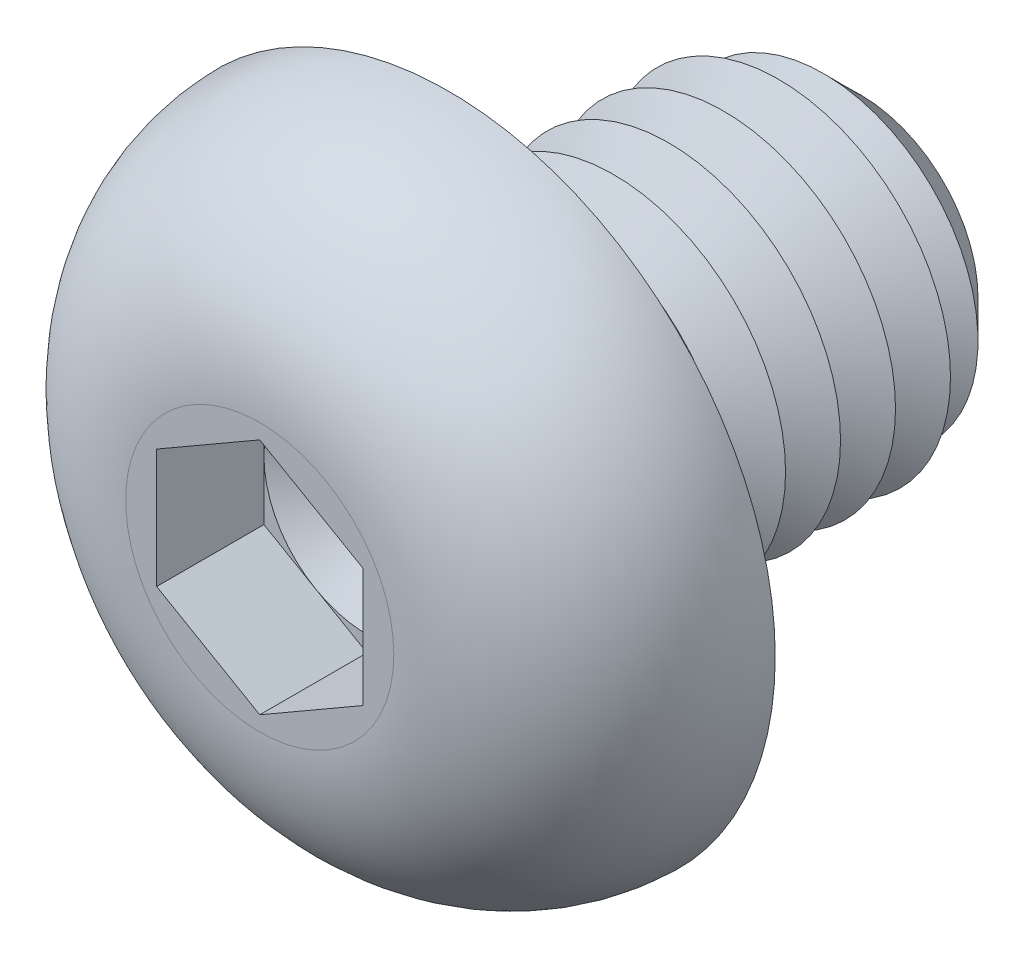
ISO-10303-21;
HEADER;
FILE_DESCRIPTION(('STEP AP214'),'2;1');
FILE_NAME('part.step','',(''),(''),'','','');
FILE_SCHEMA(('AUTOMOTIVE_DESIGN { 1 0 10303 214 1 1 1 1 }'));
ENDSEC;
DATA;
#1=APPLICATION_CONTEXT('core data for automotive mechanical design processes');
#2=APPLICATION_PROTOCOL_DEFINITION('international standard','automotive_design',2000,#1);
#3=PRODUCT_CONTEXT('',#1,'mechanical');
#4=PRODUCT('Part','Part','',(#3));
#5=PRODUCT_RELATED_PRODUCT_CATEGORY('part','',(#4));
#6=PRODUCT_DEFINITION_FORMATION('','',#4);
#7=PRODUCT_DEFINITION_CONTEXT('part definition',#1,'design');
#8=PRODUCT_DEFINITION('design','',#6,#7);
#9=PRODUCT_DEFINITION_SHAPE('','',#8);
#10=(LENGTH_UNIT() NAMED_UNIT(*) SI_UNIT(.MILLI.,.METRE.));
#11=(NAMED_UNIT(*) PLANE_ANGLE_UNIT() SI_UNIT($,.RADIAN.));
#12=(NAMED_UNIT(*) SI_UNIT($,.STERADIAN.) SOLID_ANGLE_UNIT());
#13=UNCERTAINTY_MEASURE_WITH_UNIT(LENGTH_MEASURE(1.E-05),#10,'distance_accuracy_value','');
#14=(GEOMETRIC_REPRESENTATION_CONTEXT(3) GLOBAL_UNCERTAINTY_ASSIGNED_CONTEXT((#13)) GLOBAL_UNIT_ASSIGNED_CONTEXT((#10,
#11,#12)) REPRESENTATION_CONTEXT('',''));
#15=CARTESIAN_POINT('',(0.,0.,0.));
#16=DIRECTION('',(0.,0.,1.));
#17=DIRECTION('',(1.,0.,0.));
#18=AXIS2_PLACEMENT_3D('',#15,#16,#17);
#19=CARTESIAN_POINT('',(0.,0.,1.19));
#20=DIRECTION('',(0.,0.,1.));
#21=DIRECTION('',(1.,0.,0.));
#22=AXIS2_PLACEMENT_3D('',#19,#20,#21);
#23=PLANE('',#22);
#24=CARTESIAN_POINT('',(0.,0.,1.19));
#25=DIRECTION('',(0.,0.,1.));
#26=DIRECTION('',(1.,0.,0.));
#27=AXIS2_PLACEMENT_3D('',#24,#25,#26);
#28=CIRCLE('',#27,1.5);
#29=CARTESIAN_POINT('',(1.5,0.,1.19));
#30=VERTEX_POINT('',#29);
#31=CARTESIAN_POINT('',(0.75,1.29903810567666,1.19));
#32=VERTEX_POINT('',#31);
#33=EDGE_CURVE('E117',#30,#32,#28,.T.);
#34=ORIENTED_EDGE('',*,*,#33,.F.);
#35=DIRECTION('',(0.,1.,0.));
#36=VECTOR('',#35,1.);
#37=CARTESIAN_POINT('',(1.5,-0.866025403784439,1.19));
#38=LINE('',#37,#36);
#39=CARTESIAN_POINT('',(1.5,0.86602540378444,1.19));
#40=VERTEX_POINT('',#39);
#41=EDGE_CURVE('E140',#30,#40,#38,.T.);
#42=ORIENTED_EDGE('',*,*,#41,.T.);
#43=DIRECTION('',(-0.866025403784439,0.5,0.));
#44=VECTOR('',#43,1.);
#45=CARTESIAN_POINT('',(1.5,0.86602540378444,1.19));
#46=LINE('',#45,#44);
#47=EDGE_CURVE('E135',#40,#32,#46,.T.);
#48=ORIENTED_EDGE('',*,*,#47,.T.);
#49=EDGE_LOOP('',(#34,#42,#48));
#50=FACE_BOUND('',#49,.T.);
#51=ADVANCED_FACE('F39',(#50),#23,.T.);
#52=CARTESIAN_POINT('',(0.,0.,1.19));
#53=DIRECTION('',(0.,0.,1.));
#54=DIRECTION('',(1.,0.,0.));
#55=AXIS2_PLACEMENT_3D('',#52,#53,#54);
#56=CIRCLE('',#55,1.5);
#57=CARTESIAN_POINT('',(-0.75,1.29903810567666,1.19));
#58=VERTEX_POINT('',#57);
#59=EDGE_CURVE('E11',#32,#58,#56,.T.);
#60=ORIENTED_EDGE('',*,*,#59,.F.);
#61=CARTESIAN_POINT('',(0.,1.73205080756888,1.19));
#62=VERTEX_POINT('',#61);
#63=EDGE_CURVE('E130',#32,#62,#46,.T.);
#64=ORIENTED_EDGE('',*,*,#63,.T.);
#65=DIRECTION('',(-0.866025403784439,-0.5,0.));
#66=VECTOR('',#65,1.);
#67=CARTESIAN_POINT('',(0.,1.73205080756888,1.19));
#68=LINE('',#67,#66);
#69=EDGE_CURVE('E132',#62,#58,#68,.T.);
#70=ORIENTED_EDGE('',*,*,#69,.T.);
#71=EDGE_LOOP('',(#60,#64,#70));
#72=FACE_BOUND('',#71,.T.);
#73=ADVANCED_FACE('F129',(#72),#23,.T.);
#74=CARTESIAN_POINT('',(-1.5,0.,1.19));
#75=VERTEX_POINT('',#74);
#76=EDGE_CURVE('E49',#58,#75,#56,.T.);
#77=ORIENTED_EDGE('',*,*,#76,.F.);
#78=CARTESIAN_POINT('',(-1.5,0.866025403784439,1.19));
#79=VERTEX_POINT('',#78);
#80=EDGE_CURVE('E143',#58,#79,#68,.T.);
#81=ORIENTED_EDGE('',*,*,#80,.T.);
#82=DIRECTION('',(0.,-1.,0.));
#83=VECTOR('',#82,1.);
#84=CARTESIAN_POINT('',(-1.5,0.866025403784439,1.19));
#85=LINE('',#84,#83);
#86=EDGE_CURVE('E153',#79,#75,#85,.T.);
#87=ORIENTED_EDGE('',*,*,#86,.T.);
#88=EDGE_LOOP('',(#77,#81,#87));
#89=FACE_BOUND('',#88,.T.);
#90=ADVANCED_FACE('F253',(#89),#23,.T.);
#91=CARTESIAN_POINT('',(-0.75,-1.29903810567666,1.19));
#92=VERTEX_POINT('',#91);
#93=EDGE_CURVE('E236',#75,#92,#56,.T.);
#94=ORIENTED_EDGE('',*,*,#93,.F.);
#95=CARTESIAN_POINT('',(-1.5,-0.866025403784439,1.19));
#96=VERTEX_POINT('',#95);
#97=EDGE_CURVE('E152',#75,#96,#85,.T.);
#98=ORIENTED_EDGE('',*,*,#97,.T.);
#99=DIRECTION('',(0.866025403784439,-0.5,0.));
#100=VECTOR('',#99,1.);
#101=CARTESIAN_POINT('',(-1.5,-0.866025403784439,1.19));
#102=LINE('',#101,#100);
#103=EDGE_CURVE('E158',#96,#92,#102,.T.);
#104=ORIENTED_EDGE('',*,*,#103,.T.);
#105=EDGE_LOOP('',(#94,#98,#104));
#106=FACE_BOUND('',#105,.T.);
#107=ADVANCED_FACE('F246',(#106),#23,.T.);
#108=CARTESIAN_POINT('',(0.75,-1.29903810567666,1.19));
#109=VERTEX_POINT('',#108);
#110=EDGE_CURVE('E56',#92,#109,#56,.T.);
#111=ORIENTED_EDGE('',*,*,#110,.F.);
#112=CARTESIAN_POINT('',(0.,-1.73205080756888,1.19));
#113=VERTEX_POINT('',#112);
#114=EDGE_CURVE('E157',#92,#113,#102,.T.);
#115=ORIENTED_EDGE('',*,*,#114,.T.);
#116=DIRECTION('',(0.866025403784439,0.5,0.));
#117=VECTOR('',#116,1.);
#118=CARTESIAN_POINT('',(0.,-1.73205080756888,1.19));
#119=LINE('',#118,#117);
#120=EDGE_CURVE('E163',#113,#109,#119,.T.);
#121=ORIENTED_EDGE('',*,*,#120,.T.);
#122=EDGE_LOOP('',(#111,#115,#121));
#123=FACE_BOUND('',#122,.T.);
#124=ADVANCED_FACE('F347',(#123),#23,.T.);
#125=CARTESIAN_POINT('',(0.,0.,-6.));
#126=DIRECTION('',(0.,0.,1.));
#127=DIRECTION('',(1.,0.,0.));
#128=AXIS2_PLACEMENT_3D('',#125,#126,#127);
#129=CYLINDRICAL_SURFACE('',#128,2.5);
#130=CARTESIAN_POINT('',(0.,0.,-0.4));
#131=DIRECTION('',(0.,0.,1.));
#132=DIRECTION('',(1.,0.,0.));
#133=AXIS2_PLACEMENT_3D('',#130,#131,#132);
#134=CIRCLE('',#133,2.5);
#135=CARTESIAN_POINT('',(2.5,0.,-0.4));
#136=VERTEX_POINT('',#135);
#137=EDGE_CURVE('E221',#136,#136,#134,.F.);
#138=ORIENTED_EDGE('',*,*,#137,.T.);
#139=EDGE_LOOP('',(#138));
#140=FACE_BOUND('',#139,.T.);
#141=CARTESIAN_POINT('',(0.,0.,-0.800000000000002));
#142=DIRECTION('',(0.,0.,1.));
#143=DIRECTION('',(1.,0.,0.));
#144=AXIS2_PLACEMENT_3D('',#141,#142,#143);
#145=CIRCLE('',#144,2.5);
#146=CARTESIAN_POINT('',(2.5,0.,-0.800000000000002));
#147=VERTEX_POINT('',#146);
#148=EDGE_CURVE('E149',#147,#147,#145,.T.);
#149=ORIENTED_EDGE('',*,*,#148,.T.);
#150=EDGE_LOOP('',(#149));
#151=FACE_BOUND('',#150,.T.);
#152=ADVANCED_FACE('F356',(#140,#151),#129,.T.);
#153=CARTESIAN_POINT('',(0.,4.75,0.));
#154=DIRECTION('',(0.,0.,1.));
#155=DIRECTION('',(1.,0.,0.));
#156=AXIS2_PLACEMENT_3D('',#153,#154,#155);
#157=PLANE('',#156);
#158=CARTESIAN_POINT('',(0.,0.,0.));
#159=DIRECTION('',(0.,0.,1.));
#160=DIRECTION('',(1.,0.,0.));
#161=AXIS2_PLACEMENT_3D('',#158,#159,#160);
#162=CIRCLE('',#161,2.9);
#163=CARTESIAN_POINT('',(2.9,0.,0.));
#164=VERTEX_POINT('',#163);
#165=EDGE_CURVE('E230',#164,#164,#162,.T.);
#166=ORIENTED_EDGE('',*,*,#165,.T.);
#167=EDGE_LOOP('',(#166));
#168=FACE_BOUND('',#167,.T.);
#169=CARTESIAN_POINT('',(0.,0.,0.));
#170=DIRECTION('',(0.,0.,1.));
#171=DIRECTION('',(1.,0.,0.));
#172=AXIS2_PLACEMENT_3D('',#169,#170,#171);
#173=CIRCLE('',#172,4.75);
#174=CARTESIAN_POINT('',(4.75,0.,0.));
#175=VERTEX_POINT('',#174);
#176=EDGE_CURVE('E195',#175,#175,#173,.T.);
#177=ORIENTED_EDGE('',*,*,#176,.F.);
#178=EDGE_LOOP('',(#177));
#179=FACE_BOUND('',#178,.T.);
#180=ADVANCED_FACE('F361',(#168,#179),#157,.F.);
#181=CARTESIAN_POINT('',(0.,0.,2.75));
#182=DIRECTION('',(0.,0.,-1.));
#183=DIRECTION('',(-1.,0.,0.));
#184=AXIS2_PLACEMENT_3D('',#181,#182,#183);
#185=PLANE('',#184);
#186=DIRECTION('',(-0.866025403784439,-0.5,0.));
#187=VECTOR('',#186,1.);
#188=CARTESIAN_POINT('',(0.,1.73205080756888,2.75));
#189=LINE('',#188,#187);
#190=CARTESIAN_POINT('',(0.,1.73205080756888,2.75));
#191=VERTEX_POINT('',#190);
#192=CARTESIAN_POINT('',(-1.5,0.866025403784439,2.75));
#193=VERTEX_POINT('',#192);
#194=EDGE_CURVE('E173',#191,#193,#189,.T.);
#195=ORIENTED_EDGE('',*,*,#194,.F.);
#196=DIRECTION('',(-0.866025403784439,0.5,0.));
#197=VECTOR('',#196,1.);
#198=CARTESIAN_POINT('',(1.5,0.86602540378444,2.75));
#199=LINE('',#198,#197);
#200=CARTESIAN_POINT('',(1.5,0.86602540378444,2.75));
#201=VERTEX_POINT('',#200);
#202=EDGE_CURVE('E64',#201,#191,#199,.T.);
#203=ORIENTED_EDGE('',*,*,#202,.F.);
#204=DIRECTION('',(0.,1.,0.));
#205=VECTOR('',#204,1.);
#206=CARTESIAN_POINT('',(1.5,-0.866025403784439,2.75));
#207=LINE('',#206,#205);
#208=CARTESIAN_POINT('',(1.5,-0.866025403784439,2.75));
#209=VERTEX_POINT('',#208);
#210=EDGE_CURVE('E138',#209,#201,#207,.T.);
#211=ORIENTED_EDGE('',*,*,#210,.F.);
#212=DIRECTION('',(0.866025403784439,0.5,0.));
#213=VECTOR('',#212,1.);
#214=CARTESIAN_POINT('',(0.,-1.73205080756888,2.75));
#215=LINE('',#214,#213);
#216=CARTESIAN_POINT('',(0.,-1.73205080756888,2.75));
#217=VERTEX_POINT('',#216);
#218=EDGE_CURVE('E185',#217,#209,#215,.T.);
#219=ORIENTED_EDGE('',*,*,#218,.F.);
#220=DIRECTION('',(0.866025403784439,-0.5,0.));
#221=VECTOR('',#220,1.);
#222=CARTESIAN_POINT('',(-1.5,-0.866025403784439,2.75));
#223=LINE('',#222,#221);
#224=CARTESIAN_POINT('',(-1.5,-0.866025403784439,2.75));
#225=VERTEX_POINT('',#224);
#226=EDGE_CURVE('E181',#225,#217,#223,.T.);
#227=ORIENTED_EDGE('',*,*,#226,.F.);
#228=DIRECTION('',(0.,-1.,0.));
#229=VECTOR('',#228,1.);
#230=CARTESIAN_POINT('',(-1.5,0.866025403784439,2.75));
#231=LINE('',#230,#229);
#232=EDGE_CURVE('E177',#193,#225,#231,.T.);
#233=ORIENTED_EDGE('',*,*,#232,.F.);
#234=EDGE_LOOP('',(#195,#203,#211,#219,#227,#233));
#235=FACE_BOUND('',#234,.T.);
#236=CARTESIAN_POINT('',(0.,0.,2.75));
#237=DIRECTION('',(0.,0.,1.));
#238=DIRECTION('',(1.,0.,0.));
#239=AXIS2_PLACEMENT_3D('',#236,#237,#238);
#240=CIRCLE('',#239,1.95044646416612);
#241=CARTESIAN_POINT('',(1.95044646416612,0.,2.75));
#242=VERTEX_POINT('',#241);
#243=EDGE_CURVE('E213',#242,#242,#240,.T.);
#244=ORIENTED_EDGE('',*,*,#243,.T.);
#245=EDGE_LOOP('',(#244));
#246=FACE_BOUND('',#245,.T.);
#247=ADVANCED_FACE('F262',(#235,#246),#185,.F.);
#248=CARTESIAN_POINT('',(0.,0.,-0.0500000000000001));
#249=DIRECTION('',(0.,0.,1.));
#250=DIRECTION('',(1.,0.,0.));
#251=AXIS2_PLACEMENT_3D('',#248,#249,#250);
#252=DEGENERATE_TOROIDAL_SURFACE('',#251,1.95044646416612,2.8,.T.);
#253=ORIENTED_EDGE('',*,*,#243,.F.);
#254=EDGE_LOOP('',(#253));
#255=FACE_BOUND('',#254,.T.);
#256=ORIENTED_EDGE('',*,*,#176,.T.);
#257=EDGE_LOOP('',(#256));
#258=FACE_BOUND('',#257,.T.);
#259=ADVANCED_FACE('F377',(#255,#258),#252,.T.);
#260=CARTESIAN_POINT('',(1.5,0.86602540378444,1.19));
#261=DIRECTION('',(0.5,0.866025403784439,0.));
#262=DIRECTION('',(-0.866025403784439,0.5,0.));
#263=AXIS2_PLACEMENT_3D('',#260,#261,#262);
#264=PLANE('',#263);
#265=ORIENTED_EDGE('',*,*,#202,.T.);
#266=DIRECTION('',(0.,0.,1.));
#267=VECTOR('',#266,1.);
#268=CARTESIAN_POINT('',(0.,1.73205080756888,1.19));
#269=LINE('',#268,#267);
#270=EDGE_CURVE('E136',#62,#191,#269,.T.);
#271=ORIENTED_EDGE('',*,*,#270,.F.);
#272=ORIENTED_EDGE('',*,*,#63,.F.);
#273=ORIENTED_EDGE('',*,*,#47,.F.);
#274=DIRECTION('',(0.,0.,1.));
#275=VECTOR('',#274,1.);
#276=CARTESIAN_POINT('',(1.5,0.86602540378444,1.19));
#277=LINE('',#276,#275);
#278=EDGE_CURVE('E192',#40,#201,#277,.T.);
#279=ORIENTED_EDGE('',*,*,#278,.T.);
#280=EDGE_LOOP('',(#265,#271,#272,#273,#279));
#281=FACE_BOUND('',#280,.T.);
#282=ADVANCED_FACE('F134',(#281),#264,.F.);
#283=CARTESIAN_POINT('',(1.5,-0.866025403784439,1.19));
#284=DIRECTION('',(1.,0.,0.));
#285=DIRECTION('',(0.,1.,0.));
#286=AXIS2_PLACEMENT_3D('',#283,#284,#285);
#287=PLANE('',#286);
#288=ORIENTED_EDGE('',*,*,#210,.T.);
#289=ORIENTED_EDGE('',*,*,#278,.F.);
#290=ORIENTED_EDGE('',*,*,#41,.F.);
#291=CARTESIAN_POINT('',(1.5,-0.866025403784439,1.19));
#292=VERTEX_POINT('',#291);
#293=EDGE_CURVE('E167',#292,#30,#38,.T.);
#294=ORIENTED_EDGE('',*,*,#293,.F.);
#295=DIRECTION('',(0.,0.,1.));
#296=VECTOR('',#295,1.);
#297=CARTESIAN_POINT('',(1.5,-0.866025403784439,1.19));
#298=LINE('',#297,#296);
#299=EDGE_CURVE('E196',#292,#209,#298,.T.);
#300=ORIENTED_EDGE('',*,*,#299,.T.);
#301=EDGE_LOOP('',(#288,#289,#290,#294,#300));
#302=FACE_BOUND('',#301,.T.);
#303=ADVANCED_FACE('F369',(#302),#287,.F.);
#304=CARTESIAN_POINT('',(0.,-1.73205080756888,1.19));
#305=DIRECTION('',(0.5,-0.866025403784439,0.));
#306=DIRECTION('',(0.866025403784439,0.5,0.));
#307=AXIS2_PLACEMENT_3D('',#304,#305,#306);
#308=PLANE('',#307);
#309=ORIENTED_EDGE('',*,*,#218,.T.);
#310=ORIENTED_EDGE('',*,*,#299,.F.);
#311=EDGE_CURVE('E162',#109,#292,#119,.T.);
#312=ORIENTED_EDGE('',*,*,#311,.F.);
#313=ORIENTED_EDGE('',*,*,#120,.F.);
#314=DIRECTION('',(0.,0.,1.));
#315=VECTOR('',#314,1.);
#316=CARTESIAN_POINT('',(0.,-1.73205080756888,1.19));
#317=LINE('',#316,#315);
#318=EDGE_CURVE('E199',#113,#217,#317,.T.);
#319=ORIENTED_EDGE('',*,*,#318,.T.);
#320=EDGE_LOOP('',(#309,#310,#312,#313,#319));
#321=FACE_BOUND('',#320,.T.);
#322=ADVANCED_FACE('F365',(#321),#308,.F.);
#323=CARTESIAN_POINT('',(-1.5,-0.866025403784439,1.19));
#324=DIRECTION('',(-0.5,-0.866025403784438,0.));
#325=DIRECTION('',(0.866025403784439,-0.5,0.));
#326=AXIS2_PLACEMENT_3D('',#323,#324,#325);
#327=PLANE('',#326);
#328=ORIENTED_EDGE('',*,*,#226,.T.);
#329=ORIENTED_EDGE('',*,*,#318,.F.);
#330=ORIENTED_EDGE('',*,*,#114,.F.);
#331=ORIENTED_EDGE('',*,*,#103,.F.);
#332=DIRECTION('',(0.,0.,1.));
#333=VECTOR('',#332,1.);
#334=CARTESIAN_POINT('',(-1.5,-0.866025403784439,1.19));
#335=LINE('',#334,#333);
#336=EDGE_CURVE('E202',#96,#225,#335,.T.);
#337=ORIENTED_EDGE('',*,*,#336,.T.);
#338=EDGE_LOOP('',(#328,#329,#330,#331,#337));
#339=FACE_BOUND('',#338,.T.);
#340=ADVANCED_FACE('F267',(#339),#327,.F.);
#341=CARTESIAN_POINT('',(-1.5,0.866025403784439,1.19));
#342=DIRECTION('',(-1.,0.,0.));
#343=DIRECTION('',(0.,-1.,0.));
#344=AXIS2_PLACEMENT_3D('',#341,#342,#343);
#345=PLANE('',#344);
#346=ORIENTED_EDGE('',*,*,#232,.T.);
#347=ORIENTED_EDGE('',*,*,#336,.F.);
#348=ORIENTED_EDGE('',*,*,#97,.F.);
#349=ORIENTED_EDGE('',*,*,#86,.F.);
#350=DIRECTION('',(0.,0.,1.));
#351=VECTOR('',#350,1.);
#352=CARTESIAN_POINT('',(-1.5,0.866025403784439,1.19));
#353=LINE('',#352,#351);
#354=EDGE_CURVE('E205',#79,#193,#353,.T.);
#355=ORIENTED_EDGE('',*,*,#354,.T.);
#356=EDGE_LOOP('',(#346,#347,#348,#349,#355));
#357=FACE_BOUND('',#356,.T.);
#358=ADVANCED_FACE('F251',(#357),#345,.F.);
#359=CARTESIAN_POINT('',(0.,1.73205080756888,1.19));
#360=DIRECTION('',(-0.5,0.866025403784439,0.));
#361=DIRECTION('',(-0.866025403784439,-0.5,0.));
#362=AXIS2_PLACEMENT_3D('',#359,#360,#361);
#363=PLANE('',#362);
#364=ORIENTED_EDGE('',*,*,#194,.T.);
#365=ORIENTED_EDGE('',*,*,#354,.F.);
#366=ORIENTED_EDGE('',*,*,#80,.F.);
#367=ORIENTED_EDGE('',*,*,#69,.F.);
#368=ORIENTED_EDGE('',*,*,#270,.T.);
#369=EDGE_LOOP('',(#364,#365,#366,#367,#368));
#370=FACE_BOUND('',#369,.T.);
#371=ADVANCED_FACE('F256',(#370),#363,.F.);
#372=EDGE_CURVE('E43',#109,#30,#56,.T.);
#373=ORIENTED_EDGE('',*,*,#372,.F.);
#374=ORIENTED_EDGE('',*,*,#311,.T.);
#375=ORIENTED_EDGE('',*,*,#293,.T.);
#376=EDGE_LOOP('',(#373,#374,#375));
#377=FACE_BOUND('',#376,.T.);
#378=ADVANCED_FACE('F338',(#377),#23,.T.);
#379=CARTESIAN_POINT('',(0.,0.,-0.800000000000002));
#380=DIRECTION('',(0.,0.,1.));
#381=DIRECTION('',(1.,0.,0.));
#382=AXIS2_PLACEMENT_3D('',#379,#380,#381);
#383=CONICAL_SURFACE('',#382,2.5,1.0471975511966);
#384=CARTESIAN_POINT('',(0.,0.,-1.2));
#385=DIRECTION('',(0.,0.,1.));
#386=DIRECTION('',(1.,0.,0.));
#387=AXIS2_PLACEMENT_3D('',#384,#385,#386);
#388=CIRCLE('',#387,1.80717967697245);
#389=CARTESIAN_POINT('',(1.80717967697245,0.,-1.2));
#390=VERTEX_POINT('',#389);
#391=EDGE_CURVE('E274',#390,#390,#388,.T.);
#392=ORIENTED_EDGE('',*,*,#391,.T.);
#393=EDGE_LOOP('',(#392));
#394=FACE_BOUND('',#393,.T.);
#395=ORIENTED_EDGE('',*,*,#148,.F.);
#396=EDGE_LOOP('',(#395));
#397=FACE_BOUND('',#396,.T.);
#398=ADVANCED_FACE('F345',(#394,#397),#383,.T.);
#399=CARTESIAN_POINT('',(0.,0.,-1.2));
#400=DIRECTION('',(0.,0.,-1.));
#401=DIRECTION('',(-1.,0.,0.));
#402=AXIS2_PLACEMENT_3D('',#399,#400,#401);
#403=CONICAL_SURFACE('',#402,1.80717967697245,1.04719755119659);
#404=CARTESIAN_POINT('',(0.,0.,-1.6));
#405=DIRECTION('',(0.,0.,1.));
#406=DIRECTION('',(1.,0.,0.));
#407=AXIS2_PLACEMENT_3D('',#404,#405,#406);
#408=CIRCLE('',#407,2.5);
#409=CARTESIAN_POINT('',(2.5,0.,-1.6));
#410=VERTEX_POINT('',#409);
#411=EDGE_CURVE('E272',#410,#410,#408,.T.);
#412=ORIENTED_EDGE('',*,*,#411,.T.);
#413=EDGE_LOOP('',(#412));
#414=FACE_BOUND('',#413,.T.);
#415=ORIENTED_EDGE('',*,*,#391,.F.);
#416=EDGE_LOOP('',(#415));
#417=FACE_BOUND('',#416,.T.);
#418=ADVANCED_FACE('F352',(#414,#417),#403,.T.);
#419=CARTESIAN_POINT('',(0.,0.,-1.6));
#420=DIRECTION('',(0.,0.,1.));
#421=DIRECTION('',(1.,0.,0.));
#422=AXIS2_PLACEMENT_3D('',#419,#420,#421);
#423=CONICAL_SURFACE('',#422,2.5,1.0471975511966);
#424=CARTESIAN_POINT('',(0.,0.,-2.));
#425=DIRECTION('',(0.,0.,1.));
#426=DIRECTION('',(1.,0.,0.));
#427=AXIS2_PLACEMENT_3D('',#424,#425,#426);
#428=CIRCLE('',#427,1.80717967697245);
#429=CARTESIAN_POINT('',(1.80717967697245,0.,-2.));
#430=VERTEX_POINT('',#429);
#431=EDGE_CURVE('E275',#430,#430,#428,.T.);
#432=ORIENTED_EDGE('',*,*,#431,.T.);
#433=EDGE_LOOP('',(#432));
#434=FACE_BOUND('',#433,.T.);
#435=ORIENTED_EDGE('',*,*,#411,.F.);
#436=EDGE_LOOP('',(#435));
#437=FACE_BOUND('',#436,.T.);
#438=ADVANCED_FACE('F410',(#434,#437),#423,.T.);
#439=CARTESIAN_POINT('',(0.,0.,-2.));
#440=DIRECTION('',(0.,0.,-1.));
#441=DIRECTION('',(-1.,0.,0.));
#442=AXIS2_PLACEMENT_3D('',#439,#440,#441);
#443=CONICAL_SURFACE('',#442,1.80717967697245,1.04719755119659);
#444=CARTESIAN_POINT('',(0.,0.,-2.4));
#445=DIRECTION('',(0.,0.,1.));
#446=DIRECTION('',(1.,0.,0.));
#447=AXIS2_PLACEMENT_3D('',#444,#445,#446);
#448=CIRCLE('',#447,2.5);
#449=CARTESIAN_POINT('',(2.5,0.,-2.4));
#450=VERTEX_POINT('',#449);
#451=EDGE_CURVE('E281',#450,#450,#448,.T.);
#452=ORIENTED_EDGE('',*,*,#451,.T.);
#453=EDGE_LOOP('',(#452));
#454=FACE_BOUND('',#453,.T.);
#455=ORIENTED_EDGE('',*,*,#431,.F.);
#456=EDGE_LOOP('',(#455));
#457=FACE_BOUND('',#456,.T.);
#458=ADVANCED_FACE('F414',(#454,#457),#443,.T.);
#459=CARTESIAN_POINT('',(0.,0.,-2.4));
#460=DIRECTION('',(0.,0.,1.));
#461=DIRECTION('',(1.,0.,0.));
#462=AXIS2_PLACEMENT_3D('',#459,#460,#461);
#463=CONICAL_SURFACE('',#462,2.5,1.0471975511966);
#464=CARTESIAN_POINT('',(0.,0.,-2.8));
#465=DIRECTION('',(0.,0.,1.));
#466=DIRECTION('',(1.,0.,0.));
#467=AXIS2_PLACEMENT_3D('',#464,#465,#466);
#468=CIRCLE('',#467,1.80717967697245);
#469=CARTESIAN_POINT('',(1.80717967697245,0.,-2.8));
#470=VERTEX_POINT('',#469);
#471=EDGE_CURVE('E278',#470,#470,#468,.T.);
#472=ORIENTED_EDGE('',*,*,#471,.T.);
#473=EDGE_LOOP('',(#472));
#474=FACE_BOUND('',#473,.T.);
#475=ORIENTED_EDGE('',*,*,#451,.F.);
#476=EDGE_LOOP('',(#475));
#477=FACE_BOUND('',#476,.T.);
#478=ADVANCED_FACE('F418',(#474,#477),#463,.T.);
#479=CARTESIAN_POINT('',(0.,0.,-2.8));
#480=DIRECTION('',(0.,0.,-1.));
#481=DIRECTION('',(-1.,0.,0.));
#482=AXIS2_PLACEMENT_3D('',#479,#480,#481);
#483=CONICAL_SURFACE('',#482,1.80717967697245,1.04719755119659);
#484=CARTESIAN_POINT('',(0.,0.,-3.2));
#485=DIRECTION('',(0.,0.,1.));
#486=DIRECTION('',(1.,0.,0.));
#487=AXIS2_PLACEMENT_3D('',#484,#485,#486);
#488=CIRCLE('',#487,2.5);
#489=CARTESIAN_POINT('',(2.5,0.,-3.2));
#490=VERTEX_POINT('',#489);
#491=EDGE_CURVE('E282',#490,#490,#488,.T.);
#492=ORIENTED_EDGE('',*,*,#491,.T.);
#493=EDGE_LOOP('',(#492));
#494=FACE_BOUND('',#493,.T.);
#495=ORIENTED_EDGE('',*,*,#471,.F.);
#496=EDGE_LOOP('',(#495));
#497=FACE_BOUND('',#496,.T.);
#498=ADVANCED_FACE('F422',(#494,#497),#483,.T.);
#499=CARTESIAN_POINT('',(0.,0.,-3.2));
#500=DIRECTION('',(0.,0.,1.));
#501=DIRECTION('',(1.,0.,0.));
#502=AXIS2_PLACEMENT_3D('',#499,#500,#501);
#503=CONICAL_SURFACE('',#502,2.5,1.0471975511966);
#504=CARTESIAN_POINT('',(0.,0.,-3.6));
#505=DIRECTION('',(0.,0.,1.));
#506=DIRECTION('',(1.,0.,0.));
#507=AXIS2_PLACEMENT_3D('',#504,#505,#506);
#508=CIRCLE('',#507,1.80717967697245);
#509=CARTESIAN_POINT('',(1.80717967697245,0.,-3.6));
#510=VERTEX_POINT('',#509);
#511=EDGE_CURVE('E303',#510,#510,#508,.T.);
#512=ORIENTED_EDGE('',*,*,#511,.T.);
#513=EDGE_LOOP('',(#512));
#514=FACE_BOUND('',#513,.T.);
#515=ORIENTED_EDGE('',*,*,#491,.F.);
#516=EDGE_LOOP('',(#515));
#517=FACE_BOUND('',#516,.T.);
#518=ADVANCED_FACE('F426',(#514,#517),#503,.T.);
#519=CARTESIAN_POINT('',(0.,0.,-3.6));
#520=DIRECTION('',(0.,0.,-1.));
#521=DIRECTION('',(-1.,0.,0.));
#522=AXIS2_PLACEMENT_3D('',#519,#520,#521);
#523=CONICAL_SURFACE('',#522,1.80717967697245,1.04719755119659);
#524=CARTESIAN_POINT('',(0.,0.,-4.));
#525=DIRECTION('',(0.,0.,1.));
#526=DIRECTION('',(1.,0.,0.));
#527=AXIS2_PLACEMENT_3D('',#524,#525,#526);
#528=CIRCLE('',#527,2.5);
#529=CARTESIAN_POINT('',(2.5,0.,-4.));
#530=VERTEX_POINT('',#529);
#531=EDGE_CURVE('E307',#530,#530,#528,.T.);
#532=ORIENTED_EDGE('',*,*,#531,.T.);
#533=EDGE_LOOP('',(#532));
#534=FACE_BOUND('',#533,.T.);
#535=ORIENTED_EDGE('',*,*,#511,.F.);
#536=EDGE_LOOP('',(#535));
#537=FACE_BOUND('',#536,.T.);
#538=ADVANCED_FACE('F430',(#534,#537),#523,.T.);
#539=CARTESIAN_POINT('',(0.,0.,-4.));
#540=DIRECTION('',(0.,0.,1.));
#541=DIRECTION('',(1.,0.,0.));
#542=AXIS2_PLACEMENT_3D('',#539,#540,#541);
#543=CONICAL_SURFACE('',#542,2.5,1.0471975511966);
#544=CARTESIAN_POINT('',(0.,0.,-4.4));
#545=DIRECTION('',(0.,0.,1.));
#546=DIRECTION('',(1.,0.,0.));
#547=AXIS2_PLACEMENT_3D('',#544,#545,#546);
#548=CIRCLE('',#547,1.80717967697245);
#549=CARTESIAN_POINT('',(1.80717967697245,0.,-4.4));
#550=VERTEX_POINT('',#549);
#551=EDGE_CURVE('E226',#550,#550,#548,.T.);
#552=ORIENTED_EDGE('',*,*,#551,.T.);
#553=EDGE_LOOP('',(#552));
#554=FACE_BOUND('',#553,.T.);
#555=ORIENTED_EDGE('',*,*,#531,.F.);
#556=EDGE_LOOP('',(#555));
#557=FACE_BOUND('',#556,.T.);
#558=ADVANCED_FACE('F334',(#554,#557),#543,.T.);
#559=CARTESIAN_POINT('',(0.,0.,-4.4));
#560=DIRECTION('',(0.,0.,-1.));
#561=DIRECTION('',(-1.,0.,0.));
#562=AXIS2_PLACEMENT_3D('',#559,#560,#561);
#563=CONICAL_SURFACE('',#562,1.80717967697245,1.04719755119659);
#564=CARTESIAN_POINT('',(0.,0.,-4.8));
#565=DIRECTION('',(0.,0.,1.));
#566=DIRECTION('',(1.,0.,0.));
#567=AXIS2_PLACEMENT_3D('',#564,#565,#566);
#568=CIRCLE('',#567,2.5);
#569=CARTESIAN_POINT('',(2.5,0.,-4.8));
#570=VERTEX_POINT('',#569);
#571=EDGE_CURVE('E227',#570,#570,#568,.T.);
#572=ORIENTED_EDGE('',*,*,#571,.T.);
#573=EDGE_LOOP('',(#572));
#574=FACE_BOUND('',#573,.T.);
#575=ORIENTED_EDGE('',*,*,#551,.F.);
#576=EDGE_LOOP('',(#575));
#577=FACE_BOUND('',#576,.T.);
#578=ADVANCED_FACE('F319',(#574,#577),#563,.T.);
#579=CARTESIAN_POINT('',(0.,0.,-4.8));
#580=DIRECTION('',(0.,0.,1.));
#581=DIRECTION('',(1.,0.,0.));
#582=AXIS2_PLACEMENT_3D('',#579,#580,#581);
#583=CONICAL_SURFACE('',#582,2.5,1.0471975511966);
#584=CARTESIAN_POINT('',(0.,0.,-5.2));
#585=DIRECTION('',(0.,0.,1.));
#586=DIRECTION('',(1.,0.,0.));
#587=AXIS2_PLACEMENT_3D('',#584,#585,#586);
#588=CIRCLE('',#587,1.80717967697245);
#589=CARTESIAN_POINT('',(1.80717967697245,0.,-5.2));
#590=VERTEX_POINT('',#589);
#591=EDGE_CURVE('E124',#590,#590,#588,.T.);
#592=ORIENTED_EDGE('',*,*,#591,.T.);
#593=EDGE_LOOP('',(#592));
#594=FACE_BOUND('',#593,.T.);
#595=ORIENTED_EDGE('',*,*,#571,.F.);
#596=EDGE_LOOP('',(#595));
#597=FACE_BOUND('',#596,.T.);
#598=ADVANCED_FACE('F322',(#594,#597),#583,.T.);
#599=CARTESIAN_POINT('',(0.,0.,-5.2));
#600=DIRECTION('',(0.,0.,-1.));
#601=DIRECTION('',(-1.,0.,0.));
#602=AXIS2_PLACEMENT_3D('',#599,#600,#601);
#603=CONICAL_SURFACE('',#602,1.80717967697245,1.04719755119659);
#604=CARTESIAN_POINT('',(0.,0.,-5.45358983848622));
#605=DIRECTION('',(0.,0.,-1.));
#606=DIRECTION('',(-1.,0.,0.));
#607=AXIS2_PLACEMENT_3D('',#604,#605,#606);
#608=CIRCLE('',#607,2.24641016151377);
#609=CARTESIAN_POINT('',(-2.24641016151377,0.,-5.45358983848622));
#610=VERTEX_POINT('',#609);
#611=EDGE_CURVE('E222',#610,#610,#608,.T.);
#612=ORIENTED_EDGE('',*,*,#611,.F.);
#613=EDGE_LOOP('',(#612));
#614=FACE_BOUND('',#613,.T.);
#615=ORIENTED_EDGE('',*,*,#591,.F.);
#616=EDGE_LOOP('',(#615));
#617=FACE_BOUND('',#616,.T.);
#618=ADVANCED_FACE('F324',(#614,#617),#603,.T.);
#619=CARTESIAN_POINT('',(0.,0.,-6.));
#620=DIRECTION('',(0.,0.,-1.));
#621=DIRECTION('',(-1.,0.,0.));
#622=AXIS2_PLACEMENT_3D('',#619,#620,#621);
#623=PLANE('',#622);
#624=CARTESIAN_POINT('',(0.,0.,-6.));
#625=DIRECTION('',(0.,0.,-1.));
#626=DIRECTION('',(-1.,0.,0.));
#627=AXIS2_PLACEMENT_3D('',#624,#625,#626);
#628=CIRCLE('',#627,1.7);
#629=CARTESIAN_POINT('',(-1.7,0.,-6.));
#630=VERTEX_POINT('',#629);
#631=EDGE_CURVE('E217',#630,#630,#628,.T.);
#632=ORIENTED_EDGE('',*,*,#631,.T.);
#633=EDGE_LOOP('',(#632));
#634=FACE_BOUND('',#633,.T.);
#635=ADVANCED_FACE('F331',(#634),#623,.T.);
#636=CARTESIAN_POINT('',(0.,0.,-6.));
#637=DIRECTION('',(0.,0.,1.));
#638=DIRECTION('',(1.,0.,0.));
#639=AXIS2_PLACEMENT_3D('',#636,#637,#638);
#640=CONICAL_SURFACE('',#639,1.7,0.785398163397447);
#641=ORIENTED_EDGE('',*,*,#631,.F.);
#642=EDGE_LOOP('',(#641));
#643=FACE_BOUND('',#642,.T.);
#644=ORIENTED_EDGE('',*,*,#611,.T.);
#645=EDGE_LOOP('',(#644));
#646=FACE_BOUND('',#645,.T.);
#647=ADVANCED_FACE('F390',(#643,#646),#640,.T.);
#648=CARTESIAN_POINT('',(0.,0.,-0.4));
#649=DIRECTION('',(0.,0.,1.));
#650=DIRECTION('',(1.,0.,0.));
#651=AXIS2_PLACEMENT_3D('',#648,#649,#650);
#652=TOROIDAL_SURFACE('',#651,2.9,0.4);
#653=ORIENTED_EDGE('',*,*,#165,.F.);
#654=EDGE_LOOP('',(#653));
#655=FACE_BOUND('',#654,.T.);
#656=ORIENTED_EDGE('',*,*,#137,.F.);
#657=EDGE_LOOP('',(#656));
#658=FACE_BOUND('',#657,.T.);
#659=ADVANCED_FACE('F41',(#655,#658),#652,.F.);
#660=CARTESIAN_POINT('',(0.,0.,1.19));
#661=DIRECTION('',(0.,0.,1.));
#662=DIRECTION('',(1.,0.,0.));
#663=AXIS2_PLACEMENT_3D('',#660,#661,#662);
#664=CONICAL_SURFACE('',#663,1.5,1.0471975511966);
#665=CARTESIAN_POINT('',(0.,0.,0.323974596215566));
#666=VERTEX_POINT('',#665);
#667=VERTEX_LOOP('',#666);
#668=FACE_BOUND('',#667,.T.);
#669=ORIENTED_EDGE('',*,*,#33,.T.);
#670=ORIENTED_EDGE('',*,*,#59,.T.);
#671=ORIENTED_EDGE('',*,*,#76,.T.);
#672=ORIENTED_EDGE('',*,*,#93,.T.);
#673=ORIENTED_EDGE('',*,*,#110,.T.);
#674=ORIENTED_EDGE('',*,*,#372,.T.);
#675=EDGE_LOOP('',(#669,#670,#671,#672,#673,#674));
#676=FACE_BOUND('',#675,.T.);
#677=ADVANCED_FACE('F113',(#668,#676),#664,.F.);
#678=CLOSED_SHELL('',(#51,#73,#90,#107,#124,#152,#180,#247,#259,#282,#303,#322,#340,#358,#371,
#378,#398,#418,#438,#458,#478,#498,#518,#538,#558,#578,#598,#618,#635,#647,#659,#677));
#679=MANIFOLD_SOLID_BREP('B2',#678);
#680=ADVANCED_BREP_SHAPE_REPRESENTATION('',(#18,#679),#14);
#681=SHAPE_DEFINITION_REPRESENTATION(#9,#680);
ENDSEC;
END-ISO-10303-21;
